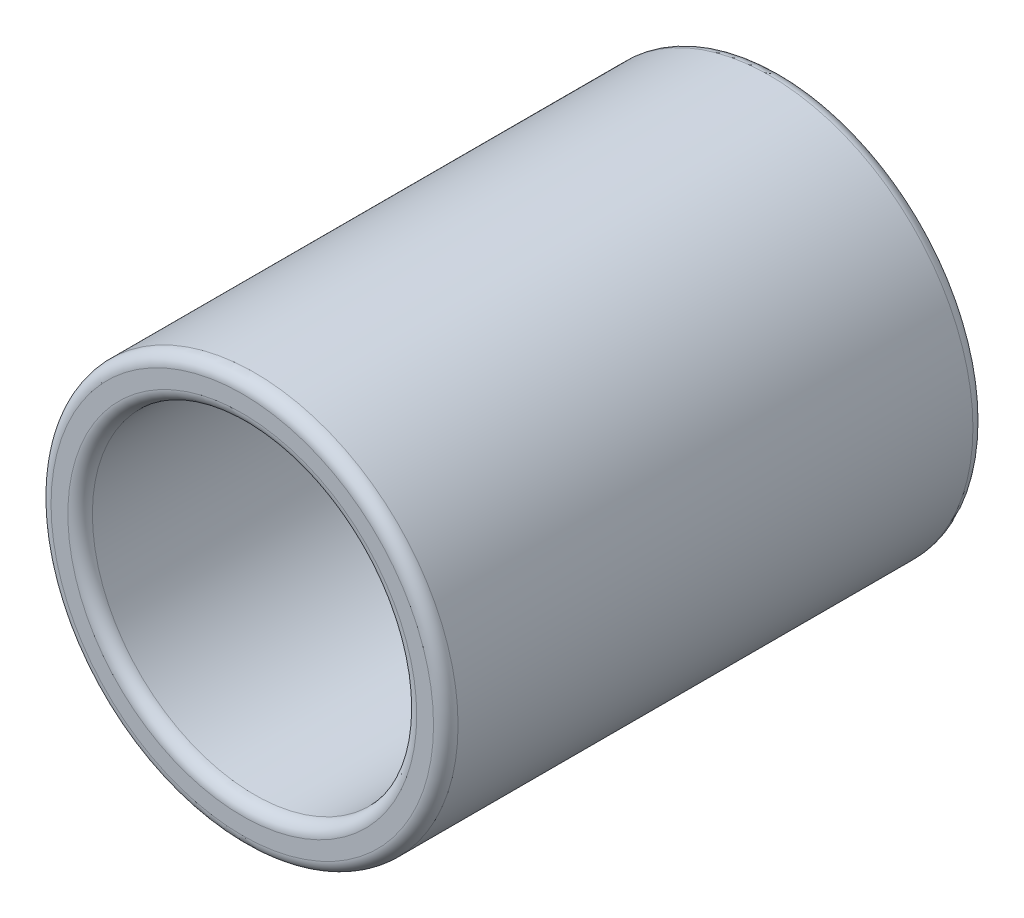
from build123d import *

# Parameters (mm, degrees)
EXTRUDE1_DEPTH      = 27.94
EXTRUDE1_DEPTH_BACK = 27.94
SKETCH1_R           = 21.082
SKETCH1_R_2         = 16.8021
EXTRUDE2_DEPTH      = 1.27
EXTRUDE2_DEPTH_BACK = 1.27
SKETCH2_R           = 16.8021
SKETCH2_R_2         = 13.010540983
FILLET1_R           = 1.27


with BuildPart() as part:
    # Sketch1 → Extrude1 (new, two sides: drawn at the far end of the back side and taken through both)
    with BuildSketch(Plane.XY.offset(-EXTRUDE1_DEPTH_BACK)):
        Circle(SKETCH1_R)
        Circle(SKETCH1_R_2, mode=Mode.SUBTRACT)
    extrude(amount=EXTRUDE1_DEPTH + EXTRUDE1_DEPTH_BACK)

    # Sketch2 → Extrude2 (add, two sides: drawn at the far end of the back side and taken through both)
    with BuildSketch(Plane.XY.offset(-EXTRUDE2_DEPTH_BACK)):
        Circle(SKETCH2_R)
        Circle(SKETCH2_R_2, mode=Mode.SUBTRACT)
    extrude(amount=EXTRUDE2_DEPTH + EXTRUDE2_DEPTH_BACK)

    # Fillet1
    fillet1_edges = [part.edges().sort_by_distance(p)[0] for p in [
        (-21.082, 0, 27.94),
        (-16.8021, 0, 27.94),
        (-21.082, 0, -27.94),
        (-16.8021, 0, -27.94),
    ]]
    fillet(fillet1_edges, radius=FILLET1_R)


solid = part.part
